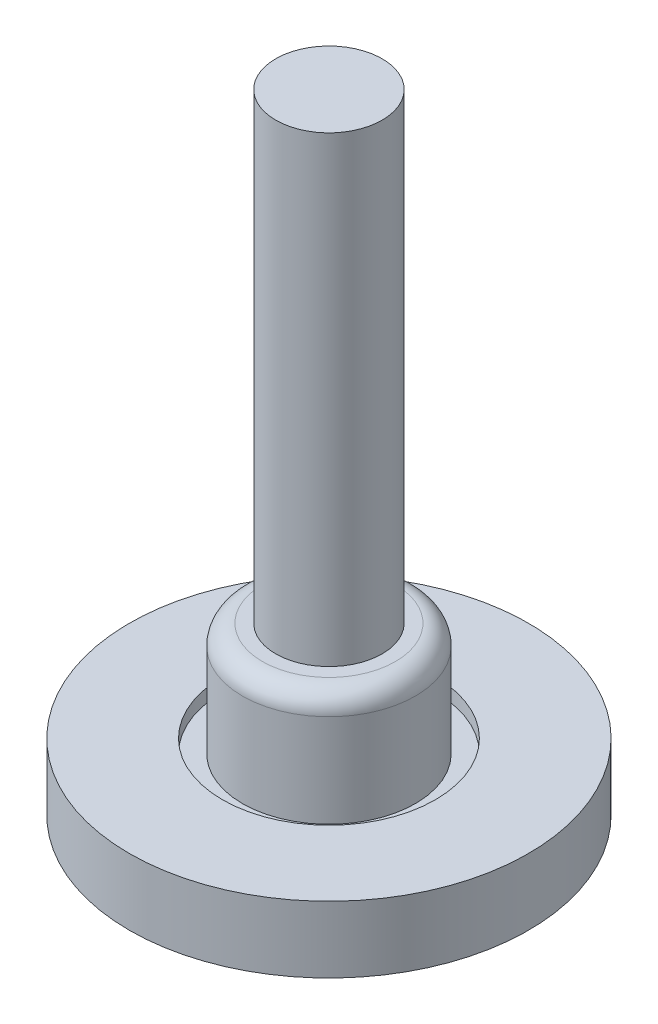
ISO-10303-21;
HEADER;
FILE_DESCRIPTION(('STEP AP214'),'2;1');
FILE_NAME('part.step','',(''),(''),'','','');
FILE_SCHEMA(('AUTOMOTIVE_DESIGN { 1 0 10303 214 1 1 1 1 }'));
ENDSEC;
DATA;
#1=APPLICATION_CONTEXT('core data for automotive mechanical design processes');
#2=APPLICATION_PROTOCOL_DEFINITION('international standard','automotive_design',2000,#1);
#3=PRODUCT_CONTEXT('',#1,'mechanical');
#4=PRODUCT('Part','Part','',(#3));
#5=PRODUCT_RELATED_PRODUCT_CATEGORY('part','',(#4));
#6=PRODUCT_DEFINITION_FORMATION('','',#4);
#7=PRODUCT_DEFINITION_CONTEXT('part definition',#1,'design');
#8=PRODUCT_DEFINITION('design','',#6,#7);
#9=PRODUCT_DEFINITION_SHAPE('','',#8);
#10=(LENGTH_UNIT() NAMED_UNIT(*) SI_UNIT(.MILLI.,.METRE.));
#11=(NAMED_UNIT(*) PLANE_ANGLE_UNIT() SI_UNIT($,.RADIAN.));
#12=(NAMED_UNIT(*) SI_UNIT($,.STERADIAN.) SOLID_ANGLE_UNIT());
#13=UNCERTAINTY_MEASURE_WITH_UNIT(LENGTH_MEASURE(1.E-05),#10,'distance_accuracy_value','');
#14=(GEOMETRIC_REPRESENTATION_CONTEXT(3) GLOBAL_UNCERTAINTY_ASSIGNED_CONTEXT((#13)) GLOBAL_UNIT_ASSIGNED_CONTEXT((#10,
#11,#12)) REPRESENTATION_CONTEXT('',''));
#15=CARTESIAN_POINT('',(0.,0.,0.));
#16=DIRECTION('',(0.,0.,1.));
#17=DIRECTION('',(1.,0.,0.));
#18=AXIS2_PLACEMENT_3D('',#15,#16,#17);
#19=CARTESIAN_POINT('',(0.,0.,0.));
#20=DIRECTION('',(0.,-1.,0.));
#21=DIRECTION('',(0.,0.,-1.));
#22=AXIS2_PLACEMENT_3D('',#19,#20,#21);
#23=PLANE('',#22);
#24=CARTESIAN_POINT('',(0.,0.,0.));
#25=DIRECTION('',(0.,1.,0.));
#26=DIRECTION('',(0.,0.,1.));
#27=AXIS2_PLACEMENT_3D('',#24,#25,#26);
#28=CIRCLE('',#27,8.);
#29=CARTESIAN_POINT('',(0.,0.,8.));
#30=VERTEX_POINT('',#29);
#31=EDGE_CURVE('E122',#30,#30,#28,.F.);
#32=ORIENTED_EDGE('',*,*,#31,.F.);
#33=EDGE_LOOP('',(#32));
#34=FACE_BOUND('',#33,.T.);
#35=ADVANCED_FACE('F17',(#34),#23,.F.);
#36=CARTESIAN_POINT('',(0.,-84.5,0.));
#37=DIRECTION('',(0.,1.,0.));
#38=DIRECTION('',(0.,0.,1.));
#39=AXIS2_PLACEMENT_3D('',#36,#37,#38);
#40=CYLINDRICAL_SURFACE('',#39,8.);
#41=ORIENTED_EDGE('',*,*,#31,.T.);
#42=EDGE_LOOP('',(#41));
#43=FACE_BOUND('',#42,.T.);
#44=CARTESIAN_POINT('',(0.,-69.5,0.));
#45=DIRECTION('',(0.,1.,0.));
#46=DIRECTION('',(0.,0.,1.));
#47=AXIS2_PLACEMENT_3D('',#44,#45,#46);
#48=CIRCLE('',#47,8.);
#49=CARTESIAN_POINT('',(0.,-69.5,8.));
#50=VERTEX_POINT('',#49);
#51=EDGE_CURVE('E42',#50,#50,#48,.T.);
#52=ORIENTED_EDGE('',*,*,#51,.T.);
#53=EDGE_LOOP('',(#52));
#54=FACE_BOUND('',#53,.T.);
#55=ADVANCED_FACE('F63',(#43,#54),#40,.T.);
#56=CARTESIAN_POINT('',(8.,-69.5,0.));
#57=DIRECTION('',(0.,-1.,0.));
#58=DIRECTION('',(0.,0.,-1.));
#59=AXIS2_PLACEMENT_3D('',#56,#57,#58);
#60=PLANE('',#59);
#61=CARTESIAN_POINT('',(0.,-69.5,0.));
#62=DIRECTION('',(0.,-1.,0.));
#63=DIRECTION('',(0.,0.,1.));
#64=AXIS2_PLACEMENT_3D('',#61,#62,#63);
#65=CIRCLE('',#64,10.);
#66=CARTESIAN_POINT('',(0.,-69.5,10.));
#67=VERTEX_POINT('',#66);
#68=CARTESIAN_POINT('',(0.,-69.5,-10.));
#69=VERTEX_POINT('',#68);
#70=EDGE_CURVE('E37',#67,#69,#65,.T.);
#71=ORIENTED_EDGE('',*,*,#70,.F.);
#72=CARTESIAN_POINT('',(0.,-69.5,0.));
#73=DIRECTION('',(0.,-1.,0.));
#74=DIRECTION('',(0.,0.,-1.));
#75=AXIS2_PLACEMENT_3D('',#72,#73,#74);
#76=CIRCLE('',#75,10.);
#77=EDGE_CURVE('E34',#69,#67,#76,.T.);
#78=ORIENTED_EDGE('',*,*,#77,.F.);
#79=EDGE_LOOP('',(#71,#78));
#80=FACE_BOUND('',#79,.T.);
#81=ORIENTED_EDGE('',*,*,#51,.F.);
#82=EDGE_LOOP('',(#81));
#83=FACE_BOUND('',#82,.T.);
#84=ADVANCED_FACE('F45',(#80,#83),#60,.F.);
#85=CARTESIAN_POINT('',(0.,-72.5,0.));
#86=DIRECTION('',(0.,1.,0.));
#87=DIRECTION('',(0.,0.,1.));
#88=AXIS2_PLACEMENT_3D('',#85,#86,#87);
#89=TOROIDAL_SURFACE('',#88,10.,3.);
#90=ORIENTED_EDGE('',*,*,#70,.T.);
#91=ORIENTED_EDGE('',*,*,#77,.T.);
#92=EDGE_LOOP('',(#90,#91));
#93=FACE_BOUND('',#92,.T.);
#94=CARTESIAN_POINT('',(0.,-72.5,0.));
#95=DIRECTION('',(0.,1.,0.));
#96=DIRECTION('',(0.,0.,1.));
#97=AXIS2_PLACEMENT_3D('',#94,#95,#96);
#98=CIRCLE('',#97,13.);
#99=CARTESIAN_POINT('',(0.,-72.5,13.));
#100=VERTEX_POINT('',#99);
#101=EDGE_CURVE('E47',#100,#100,#98,.F.);
#102=ORIENTED_EDGE('',*,*,#101,.F.);
#103=EDGE_LOOP('',(#102));
#104=FACE_BOUND('',#103,.T.);
#105=ADVANCED_FACE('F38',(#93,#104),#89,.T.);
#106=CARTESIAN_POINT('',(0.,-84.5,0.));
#107=DIRECTION('',(0.,1.,0.));
#108=DIRECTION('',(0.,0.,1.));
#109=AXIS2_PLACEMENT_3D('',#106,#107,#108);
#110=CYLINDRICAL_SURFACE('',#109,13.);
#111=ORIENTED_EDGE('',*,*,#101,.T.);
#112=EDGE_LOOP('',(#111));
#113=FACE_BOUND('',#112,.T.);
#114=CARTESIAN_POINT('',(0.,-86.5,0.));
#115=DIRECTION('',(0.,1.,0.));
#116=DIRECTION('',(0.,0.,1.));
#117=AXIS2_PLACEMENT_3D('',#114,#115,#116);
#118=CIRCLE('',#117,13.);
#119=CARTESIAN_POINT('',(0.,-86.5,13.));
#120=VERTEX_POINT('',#119);
#121=EDGE_CURVE('E111',#120,#120,#118,.T.);
#122=ORIENTED_EDGE('',*,*,#121,.T.);
#123=EDGE_LOOP('',(#122));
#124=FACE_BOUND('',#123,.T.);
#125=ADVANCED_FACE('F99',(#113,#124),#110,.T.);
#126=CARTESIAN_POINT('',(13.,-86.5,0.));
#127=DIRECTION('',(0.,-1.,0.));
#128=DIRECTION('',(0.,0.,-1.));
#129=AXIS2_PLACEMENT_3D('',#126,#127,#128);
#130=PLANE('',#129);
#131=CARTESIAN_POINT('',(0.,-86.5,0.));
#132=DIRECTION('',(0.,1.,0.));
#133=DIRECTION('',(0.,0.,1.));
#134=AXIS2_PLACEMENT_3D('',#131,#132,#133);
#135=CIRCLE('',#134,16.);
#136=CARTESIAN_POINT('',(0.,-86.5,16.));
#137=VERTEX_POINT('',#136);
#138=EDGE_CURVE('E113',#137,#137,#135,.T.);
#139=ORIENTED_EDGE('',*,*,#138,.T.);
#140=EDGE_LOOP('',(#139));
#141=FACE_BOUND('',#140,.T.);
#142=ORIENTED_EDGE('',*,*,#121,.F.);
#143=EDGE_LOOP('',(#142));
#144=FACE_BOUND('',#143,.T.);
#145=ADVANCED_FACE('F96',(#141,#144),#130,.F.);
#146=CARTESIAN_POINT('',(0.,-84.5,0.));
#147=DIRECTION('',(0.,1.,0.));
#148=DIRECTION('',(0.,0.,1.));
#149=AXIS2_PLACEMENT_3D('',#146,#147,#148);
#150=CYLINDRICAL_SURFACE('',#149,16.);
#151=ORIENTED_EDGE('',*,*,#138,.F.);
#152=EDGE_LOOP('',(#151));
#153=FACE_BOUND('',#152,.T.);
#154=CARTESIAN_POINT('',(0.,-84.5,0.));
#155=DIRECTION('',(0.,1.,0.));
#156=DIRECTION('',(0.,0.,1.));
#157=AXIS2_PLACEMENT_3D('',#154,#155,#156);
#158=CIRCLE('',#157,16.);
#159=CARTESIAN_POINT('',(0.,-84.5,16.));
#160=VERTEX_POINT('',#159);
#161=EDGE_CURVE('E116',#160,#160,#158,.T.);
#162=ORIENTED_EDGE('',*,*,#161,.T.);
#163=EDGE_LOOP('',(#162));
#164=FACE_BOUND('',#163,.T.);
#165=ADVANCED_FACE('F92',(#153,#164),#150,.F.);
#166=CARTESIAN_POINT('',(16.,-84.5,0.));
#167=DIRECTION('',(0.,-1.,0.));
#168=DIRECTION('',(0.,0.,-1.));
#169=AXIS2_PLACEMENT_3D('',#166,#167,#168);
#170=PLANE('',#169);
#171=CARTESIAN_POINT('',(0.,-84.5,0.));
#172=DIRECTION('',(0.,1.,0.));
#173=DIRECTION('',(0.,0.,1.));
#174=AXIS2_PLACEMENT_3D('',#171,#172,#173);
#175=CIRCLE('',#174,30.);
#176=CARTESIAN_POINT('',(0.,-84.5,30.));
#177=VERTEX_POINT('',#176);
#178=EDGE_CURVE('E27',#177,#177,#175,.F.);
#179=ORIENTED_EDGE('',*,*,#178,.F.);
#180=EDGE_LOOP('',(#179));
#181=FACE_BOUND('',#180,.T.);
#182=ORIENTED_EDGE('',*,*,#161,.F.);
#183=EDGE_LOOP('',(#182));
#184=FACE_BOUND('',#183,.T.);
#185=ADVANCED_FACE('F85',(#181,#184),#170,.F.);
#186=CARTESIAN_POINT('',(0.,-84.5,0.));
#187=DIRECTION('',(0.,1.,0.));
#188=DIRECTION('',(0.,0.,1.));
#189=AXIS2_PLACEMENT_3D('',#186,#187,#188);
#190=CYLINDRICAL_SURFACE('',#189,30.);
#191=ORIENTED_EDGE('',*,*,#178,.T.);
#192=EDGE_LOOP('',(#191));
#193=FACE_BOUND('',#192,.T.);
#194=CARTESIAN_POINT('',(0.,-94.5,0.));
#195=DIRECTION('',(0.,1.,0.));
#196=DIRECTION('',(0.,0.,1.));
#197=AXIS2_PLACEMENT_3D('',#194,#195,#196);
#198=CIRCLE('',#197,30.);
#199=CARTESIAN_POINT('',(0.,-94.5,30.));
#200=VERTEX_POINT('',#199);
#201=EDGE_CURVE('E11',#200,#200,#198,.T.);
#202=ORIENTED_EDGE('',*,*,#201,.T.);
#203=EDGE_LOOP('',(#202));
#204=FACE_BOUND('',#203,.T.);
#205=ADVANCED_FACE('F79',(#193,#204),#190,.T.);
#206=CARTESIAN_POINT('',(30.,-94.5,0.));
#207=DIRECTION('',(0.,1.,0.));
#208=DIRECTION('',(0.,0.,1.));
#209=AXIS2_PLACEMENT_3D('',#206,#207,#208);
#210=PLANE('',#209);
#211=ORIENTED_EDGE('',*,*,#201,.F.);
#212=EDGE_LOOP('',(#211));
#213=FACE_BOUND('',#212,.T.);
#214=ADVANCED_FACE('F77',(#213),#210,.F.);
#215=CLOSED_SHELL('',(#35,#55,#84,#105,#125,#145,#165,#185,#205,#214));
#216=MANIFOLD_SOLID_BREP('B1',#215);
#217=ADVANCED_BREP_SHAPE_REPRESENTATION('',(#18,#216),#14);
#218=SHAPE_DEFINITION_REPRESENTATION(#9,#217);
ENDSEC;
END-ISO-10303-21;
